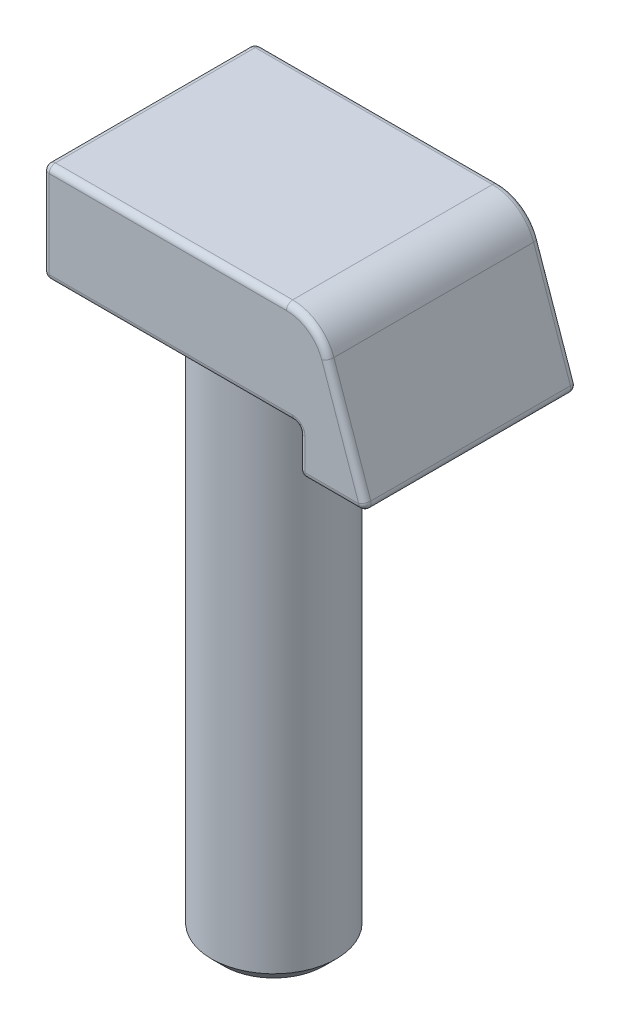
ISO-10303-21;
HEADER;
FILE_DESCRIPTION(('STEP AP214'),'2;1');
FILE_NAME('part.step','',(''),(''),'','','');
FILE_SCHEMA(('AUTOMOTIVE_DESIGN { 1 0 10303 214 1 1 1 1 }'));
ENDSEC;
DATA;
#1=APPLICATION_CONTEXT('core data for automotive mechanical design processes');
#2=APPLICATION_PROTOCOL_DEFINITION('international standard','automotive_design',2000,#1);
#3=PRODUCT_CONTEXT('',#1,'mechanical');
#4=PRODUCT('Part','Part','',(#3));
#5=PRODUCT_RELATED_PRODUCT_CATEGORY('part','',(#4));
#6=PRODUCT_DEFINITION_FORMATION('','',#4);
#7=PRODUCT_DEFINITION_CONTEXT('part definition',#1,'design');
#8=PRODUCT_DEFINITION('design','',#6,#7);
#9=PRODUCT_DEFINITION_SHAPE('','',#8);
#10=(LENGTH_UNIT() NAMED_UNIT(*) SI_UNIT(.MILLI.,.METRE.));
#11=(NAMED_UNIT(*) PLANE_ANGLE_UNIT() SI_UNIT($,.RADIAN.));
#12=(NAMED_UNIT(*) SI_UNIT($,.STERADIAN.) SOLID_ANGLE_UNIT());
#13=UNCERTAINTY_MEASURE_WITH_UNIT(LENGTH_MEASURE(1.E-05),#10,'distance_accuracy_value','');
#14=(GEOMETRIC_REPRESENTATION_CONTEXT(3) GLOBAL_UNCERTAINTY_ASSIGNED_CONTEXT((#13)) GLOBAL_UNIT_ASSIGNED_CONTEXT((#10,
#11,#12)) REPRESENTATION_CONTEXT('',''));
#15=CARTESIAN_POINT('',(0.,0.,0.));
#16=DIRECTION('',(0.,0.,1.));
#17=DIRECTION('',(1.,0.,0.));
#18=AXIS2_PLACEMENT_3D('',#15,#16,#17);
#19=CARTESIAN_POINT('',(0.5,0.,17.));
#20=DIRECTION('',(0.,1.,0.));
#21=DIRECTION('',(0.,0.,1.));
#22=AXIS2_PLACEMENT_3D('',#19,#20,#21);
#23=PLANE('',#22);
#24=DIRECTION('',(0.,0.,-1.));
#25=VECTOR('',#24,1.);
#26=CARTESIAN_POINT('',(0.5,0.,17.));
#27=LINE('',#26,#25);
#28=CARTESIAN_POINT('',(0.5,0.,16.5));
#29=VERTEX_POINT('',#28);
#30=CARTESIAN_POINT('',(0.5,0.,0.5));
#31=VERTEX_POINT('',#30);
#32=EDGE_CURVE('E735',#29,#31,#27,.T.);
#33=ORIENTED_EDGE('',*,*,#32,.T.);
#34=DIRECTION('',(1.,0.,0.));
#35=VECTOR('',#34,1.);
#36=CARTESIAN_POINT('',(0.5,0.,0.5));
#37=LINE('',#36,#35);
#38=CARTESIAN_POINT('',(20.,0.,0.500000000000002));
#39=VERTEX_POINT('',#38);
#40=EDGE_CURVE('E241',#31,#39,#37,.T.);
#41=ORIENTED_EDGE('',*,*,#40,.T.);
#42=DIRECTION('',(0.,0.,-1.));
#43=VECTOR('',#42,1.);
#44=CARTESIAN_POINT('',(20.,0.,17.));
#45=LINE('',#44,#43);
#46=CARTESIAN_POINT('',(20.,0.,16.5));
#47=VERTEX_POINT('',#46);
#48=EDGE_CURVE('E732',#47,#39,#45,.T.);
#49=ORIENTED_EDGE('',*,*,#48,.F.);
#50=DIRECTION('',(1.,0.,0.));
#51=VECTOR('',#50,1.);
#52=CARTESIAN_POINT('',(0.5,0.,16.5));
#53=LINE('',#52,#51);
#54=EDGE_CURVE('E239',#47,#29,#53,.F.);
#55=ORIENTED_EDGE('',*,*,#54,.T.);
#56=EDGE_LOOP('',(#33,#41,#49,#55));
#57=FACE_BOUND('',#56,.T.);
#58=CARTESIAN_POINT('',(10.,0.,8.50000000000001));
#59=DIRECTION('',(0.,1.,0.));
#60=DIRECTION('',(0.,0.,1.));
#61=AXIS2_PLACEMENT_3D('',#58,#59,#60);
#62=CIRCLE('',#61,5.);
#63=CARTESIAN_POINT('',(9.99999999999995,0.,13.5));
#64=VERTEX_POINT('',#63);
#65=EDGE_CURVE('E286',#64,#64,#62,.F.);
#66=ORIENTED_EDGE('',*,*,#65,.F.);
#67=EDGE_LOOP('',(#66));
#68=FACE_BOUND('',#67,.T.);
#69=ADVANCED_FACE('F34',(#57,#68),#23,.F.);
#70=CARTESIAN_POINT('',(19.5117143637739,4.50000000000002,17.));
#71=DIRECTION('',(0.,0.,-1.));
#72=DIRECTION('',(-1.,0.,0.));
#73=AXIS2_PLACEMENT_3D('',#70,#71,#72);
#74=CYLINDRICAL_SURFACE('',#73,3.5);
#75=DIRECTION('',(0.,0.,-1.));
#76=VECTOR('',#75,1.);
#77=CARTESIAN_POINT('',(22.8174531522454,5.64982218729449,17.));
#78=LINE('',#77,#76);
#79=CARTESIAN_POINT('',(22.8174531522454,5.64982218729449,16.5));
#80=VERTEX_POINT('',#79);
#81=CARTESIAN_POINT('',(22.8174531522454,5.64982218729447,0.500000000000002));
#82=VERTEX_POINT('',#81);
#83=EDGE_CURVE('E714',#80,#82,#78,.T.);
#84=ORIENTED_EDGE('',*,*,#83,.T.);
#85=CARTESIAN_POINT('',(19.5117143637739,4.5,0.500000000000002));
#86=DIRECTION('',(0.,0.,1.));
#87=DIRECTION('',(1.,0.,0.));
#88=AXIS2_PLACEMENT_3D('',#85,#86,#87);
#89=CIRCLE('',#88,3.5);
#90=CARTESIAN_POINT('',(19.5117143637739,8.00000000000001,0.5));
#91=VERTEX_POINT('',#90);
#92=EDGE_CURVE('E270',#82,#91,#89,.T.);
#93=ORIENTED_EDGE('',*,*,#92,.T.);
#94=DIRECTION('',(0.,0.,-1.));
#95=VECTOR('',#94,1.);
#96=CARTESIAN_POINT('',(19.5117143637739,8.00000000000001,17.));
#97=LINE('',#96,#95);
#98=CARTESIAN_POINT('',(19.5117143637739,8.00000000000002,16.5));
#99=VERTEX_POINT('',#98);
#100=EDGE_CURVE('E194',#99,#91,#97,.T.);
#101=ORIENTED_EDGE('',*,*,#100,.F.);
#102=CARTESIAN_POINT('',(19.5117143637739,4.50000000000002,16.5));
#103=DIRECTION('',(0.,0.,1.));
#104=DIRECTION('',(1.,0.,0.));
#105=AXIS2_PLACEMENT_3D('',#102,#103,#104);
#106=CIRCLE('',#105,3.5);
#107=EDGE_CURVE('E268',#99,#80,#106,.F.);
#108=ORIENTED_EDGE('',*,*,#107,.T.);
#109=EDGE_LOOP('',(#84,#93,#101,#108));
#110=FACE_BOUND('',#109,.T.);
#111=ADVANCED_FACE('F36',(#110),#74,.T.);
#112=CARTESIAN_POINT('',(0.5,8.00000000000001,17.));
#113=DIRECTION('',(0.,-1.,0.));
#114=DIRECTION('',(1.,0.,0.));
#115=AXIS2_PLACEMENT_3D('',#112,#113,#114);
#116=PLANE('',#115);
#117=ORIENTED_EDGE('',*,*,#100,.T.);
#118=DIRECTION('',(-1.,0.,0.));
#119=VECTOR('',#118,1.);
#120=CARTESIAN_POINT('',(0.5,8.00000000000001,0.5));
#121=LINE('',#120,#119);
#122=CARTESIAN_POINT('',(0.5,8.00000000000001,0.5));
#123=VERTEX_POINT('',#122);
#124=EDGE_CURVE('E193',#91,#123,#121,.T.);
#125=ORIENTED_EDGE('',*,*,#124,.T.);
#126=DIRECTION('',(0.,0.,-1.));
#127=VECTOR('',#126,1.);
#128=CARTESIAN_POINT('',(0.5,8.00000000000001,17.));
#129=LINE('',#128,#127);
#130=CARTESIAN_POINT('',(0.5,8.00000000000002,16.5));
#131=VERTEX_POINT('',#130);
#132=EDGE_CURVE('E175',#131,#123,#129,.T.);
#133=ORIENTED_EDGE('',*,*,#132,.F.);
#134=DIRECTION('',(-1.,0.,0.));
#135=VECTOR('',#134,1.);
#136=CARTESIAN_POINT('',(19.5117143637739,8.00000000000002,16.5));
#137=LINE('',#136,#135);
#138=EDGE_CURVE('E190',#131,#99,#137,.F.);
#139=ORIENTED_EDGE('',*,*,#138,.T.);
#140=EDGE_LOOP('',(#117,#125,#133,#139));
#141=FACE_BOUND('',#140,.T.);
#142=ADVANCED_FACE('F188',(#141),#116,.F.);
#143=CARTESIAN_POINT('',(0.5,7.50000000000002,17.));
#144=DIRECTION('',(0.,0.,-1.));
#145=DIRECTION('',(-1.,0.,0.));
#146=AXIS2_PLACEMENT_3D('',#143,#144,#145);
#147=CYLINDRICAL_SURFACE('',#146,0.5);
#148=ORIENTED_EDGE('',*,*,#132,.T.);
#149=CARTESIAN_POINT('',(0.5,7.50000000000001,0.5));
#150=DIRECTION('',(0.,0.,-1.));
#151=DIRECTION('',(-1.,0.,0.));
#152=AXIS2_PLACEMENT_3D('',#149,#150,#151);
#153=CIRCLE('',#152,0.5);
#154=CARTESIAN_POINT('',(0.,7.5,0.5));
#155=VERTEX_POINT('',#154);
#156=EDGE_CURVE('E182',#123,#155,#153,.F.);
#157=ORIENTED_EDGE('',*,*,#156,.T.);
#158=DIRECTION('',(0.,0.,-1.));
#159=VECTOR('',#158,1.);
#160=CARTESIAN_POINT('',(0.,7.50000000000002,17.));
#161=LINE('',#160,#159);
#162=CARTESIAN_POINT('',(0.,7.50000000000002,16.5));
#163=VERTEX_POINT('',#162);
#164=EDGE_CURVE('E177',#163,#155,#161,.T.);
#165=ORIENTED_EDGE('',*,*,#164,.F.);
#166=CARTESIAN_POINT('',(0.5,7.50000000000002,16.5));
#167=DIRECTION('',(0.,0.,-1.));
#168=DIRECTION('',(-1.,0.,0.));
#169=AXIS2_PLACEMENT_3D('',#166,#167,#168);
#170=CIRCLE('',#169,0.5);
#171=EDGE_CURVE('E172',#163,#131,#170,.T.);
#172=ORIENTED_EDGE('',*,*,#171,.T.);
#173=EDGE_LOOP('',(#148,#157,#165,#172));
#174=FACE_BOUND('',#173,.T.);
#175=ADVANCED_FACE('F174',(#174),#147,.T.);
#176=CARTESIAN_POINT('',(0.,0.500000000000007,17.));
#177=DIRECTION('',(1.,0.,0.));
#178=DIRECTION('',(0.,0.,-1.));
#179=AXIS2_PLACEMENT_3D('',#176,#177,#178);
#180=PLANE('',#179);
#181=ORIENTED_EDGE('',*,*,#164,.T.);
#182=DIRECTION('',(0.,-1.,0.));
#183=VECTOR('',#182,1.);
#184=CARTESIAN_POINT('',(0.,0.500000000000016,0.5));
#185=LINE('',#184,#183);
#186=CARTESIAN_POINT('',(0.,0.500000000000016,0.5));
#187=VERTEX_POINT('',#186);
#188=EDGE_CURVE('E233',#155,#187,#185,.T.);
#189=ORIENTED_EDGE('',*,*,#188,.T.);
#190=DIRECTION('',(0.,0.,-1.));
#191=VECTOR('',#190,1.);
#192=CARTESIAN_POINT('',(0.,0.500000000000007,17.));
#193=LINE('',#192,#191);
#194=CARTESIAN_POINT('',(0.,0.500000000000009,16.5));
#195=VERTEX_POINT('',#194);
#196=EDGE_CURVE('E737',#195,#187,#193,.T.);
#197=ORIENTED_EDGE('',*,*,#196,.F.);
#198=DIRECTION('',(0.,-1.,0.));
#199=VECTOR('',#198,1.);
#200=CARTESIAN_POINT('',(0.,7.50000000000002,16.5));
#201=LINE('',#200,#199);
#202=EDGE_CURVE('E231',#195,#163,#201,.F.);
#203=ORIENTED_EDGE('',*,*,#202,.T.);
#204=EDGE_LOOP('',(#181,#189,#197,#203));
#205=FACE_BOUND('',#204,.T.);
#206=ADVANCED_FACE('F319',(#205),#180,.F.);
#207=CARTESIAN_POINT('',(0.5,0.5,17.));
#208=DIRECTION('',(0.,0.,-1.));
#209=DIRECTION('',(-1.,0.,0.));
#210=AXIS2_PLACEMENT_3D('',#207,#208,#209);
#211=CYLINDRICAL_SURFACE('',#210,0.5);
#212=ORIENTED_EDGE('',*,*,#196,.T.);
#213=CARTESIAN_POINT('',(0.5,0.500000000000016,0.5));
#214=DIRECTION('',(0.,0.,-1.));
#215=DIRECTION('',(-1.,0.,0.));
#216=AXIS2_PLACEMENT_3D('',#213,#214,#215);
#217=CIRCLE('',#216,0.5);
#218=EDGE_CURVE('E237',#187,#31,#217,.F.);
#219=ORIENTED_EDGE('',*,*,#218,.T.);
#220=ORIENTED_EDGE('',*,*,#32,.F.);
#221=CARTESIAN_POINT('',(0.5,0.5,16.5));
#222=DIRECTION('',(0.,0.,-1.));
#223=DIRECTION('',(-1.,0.,0.));
#224=AXIS2_PLACEMENT_3D('',#221,#222,#223);
#225=CIRCLE('',#224,0.5);
#226=EDGE_CURVE('E235',#29,#195,#225,.T.);
#227=ORIENTED_EDGE('',*,*,#226,.T.);
#228=EDGE_LOOP('',(#212,#219,#220,#227));
#229=FACE_BOUND('',#228,.T.);
#230=ADVANCED_FACE('F316',(#229),#211,.T.);
#231=CARTESIAN_POINT('',(20.,-0.499999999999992,17.));
#232=DIRECTION('',(0.,0.,-1.));
#233=DIRECTION('',(-1.,0.,0.));
#234=AXIS2_PLACEMENT_3D('',#231,#232,#233);
#235=CYLINDRICAL_SURFACE('',#234,0.5);
#236=ORIENTED_EDGE('',*,*,#48,.T.);
#237=CARTESIAN_POINT('',(20.,-0.499999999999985,0.500000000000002));
#238=DIRECTION('',(0.,0.,1.));
#239=DIRECTION('',(1.,0.,0.));
#240=AXIS2_PLACEMENT_3D('',#237,#238,#239);
#241=CIRCLE('',#240,0.5);
#242=CARTESIAN_POINT('',(20.5,-0.499999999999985,0.500000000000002));
#243=VERTEX_POINT('',#242);
#244=EDGE_CURVE('E245',#39,#243,#241,.F.);
#245=ORIENTED_EDGE('',*,*,#244,.T.);
#246=DIRECTION('',(0.,0.,-1.));
#247=VECTOR('',#246,1.);
#248=CARTESIAN_POINT('',(20.5,-0.499999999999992,17.));
#249=LINE('',#248,#247);
#250=CARTESIAN_POINT('',(20.5,-0.499999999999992,16.5));
#251=VERTEX_POINT('',#250);
#252=EDGE_CURVE('E729',#251,#243,#249,.T.);
#253=ORIENTED_EDGE('',*,*,#252,.F.);
#254=CARTESIAN_POINT('',(20.,-0.499999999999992,16.5));
#255=DIRECTION('',(0.,0.,1.));
#256=DIRECTION('',(1.,0.,0.));
#257=AXIS2_PLACEMENT_3D('',#254,#255,#256);
#258=CIRCLE('',#257,0.5);
#259=EDGE_CURVE('E243',#251,#47,#258,.T.);
#260=ORIENTED_EDGE('',*,*,#259,.T.);
#261=EDGE_LOOP('',(#236,#245,#253,#260));
#262=FACE_BOUND('',#261,.T.);
#263=ADVANCED_FACE('F314',(#262),#235,.F.);
#264=CARTESIAN_POINT('',(20.5,-0.499999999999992,17.));
#265=DIRECTION('',(1.,0.,0.));
#266=DIRECTION('',(0.,0.,-1.));
#267=AXIS2_PLACEMENT_3D('',#264,#265,#266);
#268=PLANE('',#267);
#269=ORIENTED_EDGE('',*,*,#252,.T.);
#270=DIRECTION('',(0.,-1.,0.));
#271=VECTOR('',#270,1.);
#272=CARTESIAN_POINT('',(20.5,-0.499999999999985,0.500000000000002));
#273=LINE('',#272,#271);
#274=CARTESIAN_POINT('',(20.5,-2.99999999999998,0.5));
#275=VERTEX_POINT('',#274);
#276=EDGE_CURVE('E249',#243,#275,#273,.T.);
#277=ORIENTED_EDGE('',*,*,#276,.T.);
#278=DIRECTION('',(0.,0.,-1.));
#279=VECTOR('',#278,1.);
#280=CARTESIAN_POINT('',(20.5,-2.99999999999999,17.));
#281=LINE('',#280,#279);
#282=CARTESIAN_POINT('',(20.5,-2.99999999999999,16.5));
#283=VERTEX_POINT('',#282);
#284=EDGE_CURVE('E726',#283,#275,#281,.T.);
#285=ORIENTED_EDGE('',*,*,#284,.F.);
#286=DIRECTION('',(0.,-1.,0.));
#287=VECTOR('',#286,1.);
#288=CARTESIAN_POINT('',(20.5,-0.499999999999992,16.5));
#289=LINE('',#288,#287);
#290=EDGE_CURVE('E247',#283,#251,#289,.F.);
#291=ORIENTED_EDGE('',*,*,#290,.T.);
#292=EDGE_LOOP('',(#269,#277,#285,#291));
#293=FACE_BOUND('',#292,.T.);
#294=ADVANCED_FACE('F348',(#293),#268,.F.);
#295=CARTESIAN_POINT('',(21.,-2.99999999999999,17.));
#296=DIRECTION('',(0.,0.,-1.));
#297=DIRECTION('',(-1.,0.,0.));
#298=AXIS2_PLACEMENT_3D('',#295,#296,#297);
#299=CYLINDRICAL_SURFACE('',#298,0.5);
#300=ORIENTED_EDGE('',*,*,#284,.T.);
#301=CARTESIAN_POINT('',(21.,-2.99999999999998,0.5));
#302=DIRECTION('',(0.,0.,-1.));
#303=DIRECTION('',(-1.,0.,0.));
#304=AXIS2_PLACEMENT_3D('',#301,#302,#303);
#305=CIRCLE('',#304,0.5);
#306=CARTESIAN_POINT('',(21.,-3.49999999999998,0.500000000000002));
#307=VERTEX_POINT('',#306);
#308=EDGE_CURVE('E253',#275,#307,#305,.F.);
#309=ORIENTED_EDGE('',*,*,#308,.T.);
#310=DIRECTION('',(0.,0.,-1.));
#311=VECTOR('',#310,1.);
#312=CARTESIAN_POINT('',(21.,-3.49999999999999,17.));
#313=LINE('',#312,#311);
#314=CARTESIAN_POINT('',(21.,-3.49999999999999,16.5));
#315=VERTEX_POINT('',#314);
#316=EDGE_CURVE('E718',#315,#307,#313,.T.);
#317=ORIENTED_EDGE('',*,*,#316,.F.);
#318=CARTESIAN_POINT('',(21.,-2.99999999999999,16.5));
#319=DIRECTION('',(0.,0.,-1.));
#320=DIRECTION('',(-1.,0.,0.));
#321=AXIS2_PLACEMENT_3D('',#318,#319,#320);
#322=CIRCLE('',#321,0.5);
#323=EDGE_CURVE('E251',#315,#283,#322,.T.);
#324=ORIENTED_EDGE('',*,*,#323,.T.);
#325=EDGE_LOOP('',(#300,#309,#317,#324));
#326=FACE_BOUND('',#325,.T.);
#327=ADVANCED_FACE('F355',(#326),#299,.T.);
#328=CARTESIAN_POINT('',(21.,-3.49999999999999,17.));
#329=DIRECTION('',(0.,1.,0.));
#330=DIRECTION('',(0.,0.,1.));
#331=AXIS2_PLACEMENT_3D('',#328,#329,#330);
#332=PLANE('',#331);
#333=ORIENTED_EDGE('',*,*,#316,.T.);
#334=DIRECTION('',(1.,0.,0.));
#335=VECTOR('',#334,1.);
#336=CARTESIAN_POINT('',(21.,-3.49999999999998,0.500000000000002));
#337=LINE('',#336,#335);
#338=CARTESIAN_POINT('',(25.2967045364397,-3.49999999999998,0.500000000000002));
#339=VERTEX_POINT('',#338);
#340=EDGE_CURVE('E257',#307,#339,#337,.T.);
#341=ORIENTED_EDGE('',*,*,#340,.T.);
#342=DIRECTION('',(0.,0.,-1.));
#343=VECTOR('',#342,1.);
#344=CARTESIAN_POINT('',(25.2967045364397,-3.49999999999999,17.));
#345=LINE('',#344,#343);
#346=CARTESIAN_POINT('',(25.2967045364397,-3.49999999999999,16.5));
#347=VERTEX_POINT('',#346);
#348=EDGE_CURVE('E716',#347,#339,#345,.T.);
#349=ORIENTED_EDGE('',*,*,#348,.F.);
#350=DIRECTION('',(1.,0.,0.));
#351=VECTOR('',#350,1.);
#352=CARTESIAN_POINT('',(21.,-3.49999999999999,16.5));
#353=LINE('',#352,#351);
#354=EDGE_CURVE('E255',#347,#315,#353,.F.);
#355=ORIENTED_EDGE('',*,*,#354,.T.);
#356=EDGE_LOOP('',(#333,#341,#349,#355));
#357=FACE_BOUND('',#356,.T.);
#358=ADVANCED_FACE('F362',(#357),#332,.F.);
#359=CARTESIAN_POINT('',(25.2967045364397,-2.99999999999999,17.));
#360=DIRECTION('',(0.,0.,-1.));
#361=DIRECTION('',(-1.,0.,0.));
#362=AXIS2_PLACEMENT_3D('',#359,#360,#361);
#363=CYLINDRICAL_SURFACE('',#362,0.5);
#364=ORIENTED_EDGE('',*,*,#348,.T.);
#365=CARTESIAN_POINT('',(25.2967045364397,-2.99999999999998,0.5));
#366=DIRECTION('',(0.,0.,-1.));
#367=DIRECTION('',(-1.,0.,0.));
#368=AXIS2_PLACEMENT_3D('',#365,#366,#367);
#369=CIRCLE('',#368,0.5);
#370=CARTESIAN_POINT('',(25.7689529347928,-2.83573968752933,0.5));
#371=VERTEX_POINT('',#370);
#372=EDGE_CURVE('E261',#339,#371,#369,.F.);
#373=ORIENTED_EDGE('',*,*,#372,.T.);
#374=DIRECTION('',(0.,0.,-1.));
#375=VECTOR('',#374,1.);
#376=CARTESIAN_POINT('',(25.7689529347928,-2.83573968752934,17.));
#377=LINE('',#376,#375);
#378=CARTESIAN_POINT('',(25.7689529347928,-2.83573968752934,16.5));
#379=VERTEX_POINT('',#378);
#380=EDGE_CURVE('E711',#379,#371,#377,.T.);
#381=ORIENTED_EDGE('',*,*,#380,.F.);
#382=CARTESIAN_POINT('',(25.2967045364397,-2.99999999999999,16.5));
#383=DIRECTION('',(0.,0.,-1.));
#384=DIRECTION('',(-1.,0.,0.));
#385=AXIS2_PLACEMENT_3D('',#382,#383,#384);
#386=CIRCLE('',#385,0.5);
#387=EDGE_CURVE('E259',#379,#347,#386,.T.);
#388=ORIENTED_EDGE('',*,*,#387,.T.);
#389=EDGE_LOOP('',(#364,#373,#381,#388));
#390=FACE_BOUND('',#389,.T.);
#391=ADVANCED_FACE('F370',(#390),#363,.T.);
#392=CARTESIAN_POINT('',(25.7689529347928,-2.83573968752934,17.));
#393=DIRECTION('',(-0.944496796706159,-0.328520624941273,0.));
#394=DIRECTION('',(0.328520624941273,-0.944496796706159,0.));
#395=AXIS2_PLACEMENT_3D('',#392,#393,#394);
#396=PLANE('',#395);
#397=ORIENTED_EDGE('',*,*,#380,.T.);
#398=DIRECTION('',(-0.328520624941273,0.944496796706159,0.));
#399=VECTOR('',#398,1.);
#400=CARTESIAN_POINT('',(25.7689529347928,-2.83573968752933,0.5));
#401=LINE('',#400,#399);
#402=EDGE_CURVE('E266',#371,#82,#401,.T.);
#403=ORIENTED_EDGE('',*,*,#402,.T.);
#404=ORIENTED_EDGE('',*,*,#83,.F.);
#405=DIRECTION('',(-0.328520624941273,0.944496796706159,0.));
#406=VECTOR('',#405,1.);
#407=CARTESIAN_POINT('',(25.7689529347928,-2.83573968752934,16.5));
#408=LINE('',#407,#406);
#409=EDGE_CURVE('E263',#80,#379,#408,.F.);
#410=ORIENTED_EDGE('',*,*,#409,.T.);
#411=EDGE_LOOP('',(#397,#403,#404,#410));
#412=FACE_BOUND('',#411,.T.);
#413=ADVANCED_FACE('F378',(#412),#396,.F.);
#414=CARTESIAN_POINT('',(19.5117143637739,4.50000000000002,17.));
#415=DIRECTION('',(0.,0.,1.));
#416=DIRECTION('',(1.,0.,0.));
#417=AXIS2_PLACEMENT_3D('',#414,#415,#416);
#418=PLANE('',#417);
#419=DIRECTION('',(1.,0.,0.));
#420=VECTOR('',#419,1.);
#421=CARTESIAN_POINT('',(25.2967045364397,-2.99999999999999,17.));
#422=LINE('',#421,#420);
#423=CARTESIAN_POINT('',(21.,-2.99999999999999,17.));
#424=VERTEX_POINT('',#423);
#425=CARTESIAN_POINT('',(25.2967045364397,-2.99999999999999,17.));
#426=VERTEX_POINT('',#425);
#427=EDGE_CURVE('E49',#424,#426,#422,.T.);
#428=ORIENTED_EDGE('',*,*,#427,.T.);
#429=DIRECTION('',(-0.328520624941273,0.944496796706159,0.));
#430=VECTOR('',#429,1.);
#431=CARTESIAN_POINT('',(22.3452047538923,5.48556187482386,17.));
#432=LINE('',#431,#430);
#433=CARTESIAN_POINT('',(22.3452047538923,5.48556187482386,17.));
#434=VERTEX_POINT('',#433);
#435=EDGE_CURVE('E284',#426,#434,#432,.T.);
#436=ORIENTED_EDGE('',*,*,#435,.T.);
#437=CARTESIAN_POINT('',(19.5117143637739,4.50000000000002,17.));
#438=DIRECTION('',(0.,0.,1.));
#439=DIRECTION('',(1.,0.,0.));
#440=AXIS2_PLACEMENT_3D('',#437,#438,#439);
#441=CIRCLE('',#440,3.);
#442=CARTESIAN_POINT('',(19.5117143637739,7.50000000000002,17.));
#443=VERTEX_POINT('',#442);
#444=EDGE_CURVE('E272',#434,#443,#441,.T.);
#445=ORIENTED_EDGE('',*,*,#444,.T.);
#446=DIRECTION('',(-1.,0.,0.));
#447=VECTOR('',#446,1.);
#448=CARTESIAN_POINT('',(0.5,7.50000000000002,17.));
#449=LINE('',#448,#447);
#450=CARTESIAN_POINT('',(0.5,7.50000000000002,17.));
#451=VERTEX_POINT('',#450);
#452=EDGE_CURVE('E274',#443,#451,#449,.T.);
#453=ORIENTED_EDGE('',*,*,#452,.T.);
#454=DIRECTION('',(0.,-1.,0.));
#455=VECTOR('',#454,1.);
#456=CARTESIAN_POINT('',(0.5,0.500000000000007,17.));
#457=LINE('',#456,#455);
#458=CARTESIAN_POINT('',(0.5,0.5,17.));
#459=VERTEX_POINT('',#458);
#460=EDGE_CURVE('E276',#451,#459,#457,.T.);
#461=ORIENTED_EDGE('',*,*,#460,.T.);
#462=DIRECTION('',(1.,0.,0.));
#463=VECTOR('',#462,1.);
#464=CARTESIAN_POINT('',(20.,0.500000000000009,17.));
#465=LINE('',#464,#463);
#466=CARTESIAN_POINT('',(20.,0.500000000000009,17.));
#467=VERTEX_POINT('',#466);
#468=EDGE_CURVE('E278',#459,#467,#465,.T.);
#469=ORIENTED_EDGE('',*,*,#468,.T.);
#470=CARTESIAN_POINT('',(20.,-0.499999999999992,17.));
#471=DIRECTION('',(0.,0.,1.));
#472=DIRECTION('',(1.,0.,0.));
#473=AXIS2_PLACEMENT_3D('',#470,#471,#472);
#474=CIRCLE('',#473,1.);
#475=CARTESIAN_POINT('',(21.,-0.499999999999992,17.));
#476=VERTEX_POINT('',#475);
#477=EDGE_CURVE('E280',#467,#476,#474,.F.);
#478=ORIENTED_EDGE('',*,*,#477,.T.);
#479=DIRECTION('',(0.,-1.,0.));
#480=VECTOR('',#479,1.);
#481=CARTESIAN_POINT('',(21.,-2.99999999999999,17.));
#482=LINE('',#481,#480);
#483=EDGE_CURVE('E54',#476,#424,#482,.T.);
#484=ORIENTED_EDGE('',*,*,#483,.T.);
#485=EDGE_LOOP('',(#428,#436,#445,#453,#461,#469,#478,#484));
#486=FACE_BOUND('',#485,.T.);
#487=ADVANCED_FACE('F386',(#486),#418,.T.);
#488=CARTESIAN_POINT('',(19.5117143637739,4.5,0.));
#489=DIRECTION('',(0.,0.,1.));
#490=DIRECTION('',(1.,0.,0.));
#491=AXIS2_PLACEMENT_3D('',#488,#489,#490);
#492=PLANE('',#491);
#493=DIRECTION('',(0.,-1.,0.));
#494=VECTOR('',#493,1.);
#495=CARTESIAN_POINT('',(0.5,4.50000000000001,0.));
#496=LINE('',#495,#494);
#497=CARTESIAN_POINT('',(0.5,0.5,0.));
#498=VERTEX_POINT('',#497);
#499=CARTESIAN_POINT('',(0.5,7.50000000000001,0.));
#500=VERTEX_POINT('',#499);
#501=EDGE_CURVE('E226',#498,#500,#496,.F.);
#502=ORIENTED_EDGE('',*,*,#501,.T.);
#503=DIRECTION('',(-1.,0.,0.));
#504=VECTOR('',#503,1.);
#505=CARTESIAN_POINT('',(19.5117143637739,7.50000000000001,0.));
#506=LINE('',#505,#504);
#507=CARTESIAN_POINT('',(19.5117143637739,7.50000000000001,0.));
#508=VERTEX_POINT('',#507);
#509=EDGE_CURVE('E183',#500,#508,#506,.F.);
#510=ORIENTED_EDGE('',*,*,#509,.T.);
#511=CARTESIAN_POINT('',(19.5117143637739,4.5,0.));
#512=DIRECTION('',(0.,0.,1.));
#513=DIRECTION('',(1.,0.,0.));
#514=AXIS2_PLACEMENT_3D('',#511,#512,#513);
#515=CIRCLE('',#514,3.);
#516=CARTESIAN_POINT('',(22.3452047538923,5.48556187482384,0.));
#517=VERTEX_POINT('',#516);
#518=EDGE_CURVE('E211',#508,#517,#515,.F.);
#519=ORIENTED_EDGE('',*,*,#518,.T.);
#520=DIRECTION('',(-0.328520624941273,0.944496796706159,0.));
#521=VECTOR('',#520,1.);
#522=CARTESIAN_POINT('',(22.3452047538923,5.48556187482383,0.));
#523=LINE('',#522,#521);
#524=CARTESIAN_POINT('',(25.2967045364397,-3.,0.));
#525=VERTEX_POINT('',#524);
#526=EDGE_CURVE('E216',#517,#525,#523,.F.);
#527=ORIENTED_EDGE('',*,*,#526,.T.);
#528=DIRECTION('',(1.,0.,0.));
#529=VECTOR('',#528,1.);
#530=CARTESIAN_POINT('',(19.5117143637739,-2.99999999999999,0.));
#531=LINE('',#530,#529);
#532=CARTESIAN_POINT('',(21.,-3.,0.));
#533=VERTEX_POINT('',#532);
#534=EDGE_CURVE('E218',#525,#533,#531,.F.);
#535=ORIENTED_EDGE('',*,*,#534,.T.);
#536=DIRECTION('',(0.,-1.,0.));
#537=VECTOR('',#536,1.);
#538=CARTESIAN_POINT('',(21.,4.50000000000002,0.));
#539=LINE('',#538,#537);
#540=CARTESIAN_POINT('',(21.,-0.500000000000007,0.));
#541=VERTEX_POINT('',#540);
#542=EDGE_CURVE('E220',#533,#541,#539,.F.);
#543=ORIENTED_EDGE('',*,*,#542,.T.);
#544=CARTESIAN_POINT('',(20.,-0.5,0.));
#545=DIRECTION('',(0.,0.,1.));
#546=DIRECTION('',(1.,0.,0.));
#547=AXIS2_PLACEMENT_3D('',#544,#545,#546);
#548=CIRCLE('',#547,1.);
#549=CARTESIAN_POINT('',(20.,0.5,0.));
#550=VERTEX_POINT('',#549);
#551=EDGE_CURVE('E222',#541,#550,#548,.T.);
#552=ORIENTED_EDGE('',*,*,#551,.T.);
#553=DIRECTION('',(1.,0.,0.));
#554=VECTOR('',#553,1.);
#555=CARTESIAN_POINT('',(19.5117143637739,0.5,0.));
#556=LINE('',#555,#554);
#557=EDGE_CURVE('E224',#550,#498,#556,.F.);
#558=ORIENTED_EDGE('',*,*,#557,.T.);
#559=EDGE_LOOP('',(#502,#510,#519,#527,#535,#543,#552,#558));
#560=FACE_BOUND('',#559,.T.);
#561=ADVANCED_FACE('F394',(#560),#492,.F.);
#562=CARTESIAN_POINT('',(21.,-0.499999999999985,0.500000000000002));
#563=DIRECTION('',(0.,-1.,0.));
#564=DIRECTION('',(0.,0.,-1.));
#565=AXIS2_PLACEMENT_3D('',#562,#563,#564);
#566=CYLINDRICAL_SURFACE('',#565,0.5);
#567=CARTESIAN_POINT('',(21.,-2.99999999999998,0.5));
#568=DIRECTION('',(0.,-1.,0.));
#569=DIRECTION('',(0.,0.,-1.));
#570=AXIS2_PLACEMENT_3D('',#567,#568,#569);
#571=CIRCLE('',#570,0.5);
#572=EDGE_CURVE('E720',#275,#533,#571,.T.);
#573=ORIENTED_EDGE('',*,*,#572,.F.);
#574=ORIENTED_EDGE('',*,*,#276,.F.);
#575=CARTESIAN_POINT('',(21.,-0.499999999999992,0.500000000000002));
#576=DIRECTION('',(0.,1.,0.));
#577=DIRECTION('',(-1.,0.,0.));
#578=AXIS2_PLACEMENT_3D('',#575,#576,#577);
#579=CIRCLE('',#578,0.5);
#580=EDGE_CURVE('E778',#541,#243,#579,.T.);
#581=ORIENTED_EDGE('',*,*,#580,.F.);
#582=ORIENTED_EDGE('',*,*,#542,.F.);
#583=EDGE_LOOP('',(#573,#574,#581,#582));
#584=FACE_BOUND('',#583,.T.);
#585=ADVANCED_FACE('F401',(#584),#566,.T.);
#586=CARTESIAN_POINT('',(21.,-2.99999999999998,0.5));
#587=DIRECTION('',(0.,0.,1.));
#588=DIRECTION('',(1.,0.,0.));
#589=AXIS2_PLACEMENT_3D('',#586,#587,#588);
#590=SPHERICAL_SURFACE('',#589,0.5);
#591=ORIENTED_EDGE('',*,*,#308,.F.);
#592=ORIENTED_EDGE('',*,*,#572,.T.);
#593=CARTESIAN_POINT('',(21.,-2.99999999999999,0.5));
#594=DIRECTION('',(1.,0.,0.));
#595=DIRECTION('',(0.,1.,0.));
#596=AXIS2_PLACEMENT_3D('',#593,#594,#595);
#597=CIRCLE('',#596,0.5);
#598=EDGE_CURVE('E775',#307,#533,#597,.T.);
#599=ORIENTED_EDGE('',*,*,#598,.F.);
#600=EDGE_LOOP('',(#591,#592,#599));
#601=FACE_BOUND('',#600,.T.);
#602=ADVANCED_FACE('F409',(#601),#590,.T.);
#603=CARTESIAN_POINT('',(20.,-0.499999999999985,0.500000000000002));
#604=DIRECTION('',(0.,0.,1.));
#605=DIRECTION('',(1.,0.,0.));
#606=AXIS2_PLACEMENT_3D('',#603,#604,#605);
#607=TOROIDAL_SURFACE('',#606,1.,0.5);
#608=ORIENTED_EDGE('',*,*,#580,.T.);
#609=ORIENTED_EDGE('',*,*,#244,.F.);
#610=CARTESIAN_POINT('',(20.,0.500000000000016,0.500000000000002));
#611=DIRECTION('',(-1.,0.,0.));
#612=DIRECTION('',(0.,0.,1.));
#613=AXIS2_PLACEMENT_3D('',#610,#611,#612);
#614=CIRCLE('',#613,0.5);
#615=EDGE_CURVE('E772',#550,#39,#614,.T.);
#616=ORIENTED_EDGE('',*,*,#615,.F.);
#617=ORIENTED_EDGE('',*,*,#551,.F.);
#618=EDGE_LOOP('',(#608,#609,#616,#617));
#619=FACE_BOUND('',#618,.T.);
#620=ADVANCED_FACE('F417',(#619),#607,.T.);
#621=CARTESIAN_POINT('',(21.,-2.99999999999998,0.5));
#622=DIRECTION('',(1.,0.,0.));
#623=DIRECTION('',(0.,0.,-1.));
#624=AXIS2_PLACEMENT_3D('',#621,#622,#623);
#625=CYLINDRICAL_SURFACE('',#624,0.5);
#626=ORIENTED_EDGE('',*,*,#598,.T.);
#627=ORIENTED_EDGE('',*,*,#534,.F.);
#628=CARTESIAN_POINT('',(25.2967045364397,-2.99999999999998,0.5));
#629=DIRECTION('',(1.,0.,0.));
#630=DIRECTION('',(0.,0.,-1.));
#631=AXIS2_PLACEMENT_3D('',#628,#629,#630);
#632=CIRCLE('',#631,0.5);
#633=EDGE_CURVE('E769',#339,#525,#632,.T.);
#634=ORIENTED_EDGE('',*,*,#633,.F.);
#635=ORIENTED_EDGE('',*,*,#340,.F.);
#636=EDGE_LOOP('',(#626,#627,#634,#635));
#637=FACE_BOUND('',#636,.T.);
#638=ADVANCED_FACE('F425',(#637),#625,.T.);
#639=CARTESIAN_POINT('',(0.5,0.500000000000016,0.5));
#640=DIRECTION('',(1.,0.,0.));
#641=DIRECTION('',(0.,0.,-1.));
#642=AXIS2_PLACEMENT_3D('',#639,#640,#641);
#643=CYLINDRICAL_SURFACE('',#642,0.5);
#644=ORIENTED_EDGE('',*,*,#615,.T.);
#645=ORIENTED_EDGE('',*,*,#40,.F.);
#646=CARTESIAN_POINT('',(0.5,0.500000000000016,0.5));
#647=DIRECTION('',(-1.,0.,0.));
#648=DIRECTION('',(0.,-1.,0.));
#649=AXIS2_PLACEMENT_3D('',#646,#647,#648);
#650=CIRCLE('',#649,0.5);
#651=EDGE_CURVE('E766',#498,#31,#650,.T.);
#652=ORIENTED_EDGE('',*,*,#651,.F.);
#653=ORIENTED_EDGE('',*,*,#557,.F.);
#654=EDGE_LOOP('',(#644,#645,#652,#653));
#655=FACE_BOUND('',#654,.T.);
#656=ADVANCED_FACE('F433',(#655),#643,.T.);
#657=CARTESIAN_POINT('',(25.2967045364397,-2.99999999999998,0.5));
#658=DIRECTION('',(0.,0.,1.));
#659=DIRECTION('',(1.,0.,0.));
#660=AXIS2_PLACEMENT_3D('',#657,#658,#659);
#661=SPHERICAL_SURFACE('',#660,0.5);
#662=ORIENTED_EDGE('',*,*,#372,.F.);
#663=ORIENTED_EDGE('',*,*,#633,.T.);
#664=CARTESIAN_POINT('',(25.2967045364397,-2.99999999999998,0.5));
#665=DIRECTION('',(-0.328520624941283,0.944496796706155,0.));
#666=DIRECTION('',(-0.944496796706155,-0.328520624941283,0.));
#667=AXIS2_PLACEMENT_3D('',#664,#665,#666);
#668=CIRCLE('',#667,0.5);
#669=EDGE_CURVE('E763',#371,#525,#668,.T.);
#670=ORIENTED_EDGE('',*,*,#669,.F.);
#671=EDGE_LOOP('',(#662,#663,#670));
#672=FACE_BOUND('',#671,.T.);
#673=ADVANCED_FACE('F441',(#672),#661,.T.);
#674=CARTESIAN_POINT('',(0.5,0.500000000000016,0.5));
#675=DIRECTION('',(0.,0.,1.));
#676=DIRECTION('',(1.,0.,0.));
#677=AXIS2_PLACEMENT_3D('',#674,#675,#676);
#678=SPHERICAL_SURFACE('',#677,0.5);
#679=ORIENTED_EDGE('',*,*,#651,.T.);
#680=ORIENTED_EDGE('',*,*,#218,.F.);
#681=CARTESIAN_POINT('',(0.5,0.500000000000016,0.5));
#682=DIRECTION('',(0.,1.,0.));
#683=DIRECTION('',(-1.,0.,0.));
#684=AXIS2_PLACEMENT_3D('',#681,#682,#683);
#685=CIRCLE('',#684,0.5);
#686=EDGE_CURVE('E750',#498,#187,#685,.T.);
#687=ORIENTED_EDGE('',*,*,#686,.F.);
#688=EDGE_LOOP('',(#679,#680,#687));
#689=FACE_BOUND('',#688,.T.);
#690=ADVANCED_FACE('F449',(#689),#678,.T.);
#691=CARTESIAN_POINT('',(25.2967045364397,-2.99999999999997,0.5));
#692=DIRECTION('',(-0.328520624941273,0.944496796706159,0.));
#693=DIRECTION('',(-0.944496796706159,-0.328520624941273,0.));
#694=AXIS2_PLACEMENT_3D('',#691,#692,#693);
#695=CYLINDRICAL_SURFACE('',#694,0.5);
#696=ORIENTED_EDGE('',*,*,#669,.T.);
#697=ORIENTED_EDGE('',*,*,#526,.F.);
#698=CARTESIAN_POINT('',(22.3452047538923,5.48556187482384,0.500000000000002));
#699=DIRECTION('',(-0.328520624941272,0.944496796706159,0.));
#700=DIRECTION('',(-0.944496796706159,-0.328520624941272,0.));
#701=AXIS2_PLACEMENT_3D('',#698,#699,#700);
#702=CIRCLE('',#701,0.5);
#703=EDGE_CURVE('E754',#82,#517,#702,.T.);
#704=ORIENTED_EDGE('',*,*,#703,.F.);
#705=ORIENTED_EDGE('',*,*,#402,.F.);
#706=EDGE_LOOP('',(#696,#697,#704,#705));
#707=FACE_BOUND('',#706,.T.);
#708=ADVANCED_FACE('F457',(#707),#695,.T.);
#709=CARTESIAN_POINT('',(0.5,0.500000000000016,0.5));
#710=DIRECTION('',(0.,-1.,0.));
#711=DIRECTION('',(0.,0.,-1.));
#712=AXIS2_PLACEMENT_3D('',#709,#710,#711);
#713=CYLINDRICAL_SURFACE('',#712,0.5);
#714=ORIENTED_EDGE('',*,*,#686,.T.);
#715=ORIENTED_EDGE('',*,*,#188,.F.);
#716=CARTESIAN_POINT('',(0.5,7.50000000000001,0.5));
#717=DIRECTION('',(0.,1.,0.));
#718=DIRECTION('',(-1.,0.,0.));
#719=AXIS2_PLACEMENT_3D('',#716,#717,#718);
#720=CIRCLE('',#719,0.5);
#721=EDGE_CURVE('E747',#500,#155,#720,.T.);
#722=ORIENTED_EDGE('',*,*,#721,.F.);
#723=ORIENTED_EDGE('',*,*,#501,.F.);
#724=EDGE_LOOP('',(#714,#715,#722,#723));
#725=FACE_BOUND('',#724,.T.);
#726=ADVANCED_FACE('F465',(#725),#713,.T.);
#727=CARTESIAN_POINT('',(19.5117143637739,4.5,0.500000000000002));
#728=DIRECTION('',(0.,0.,1.));
#729=DIRECTION('',(1.,0.,0.));
#730=AXIS2_PLACEMENT_3D('',#727,#728,#729);
#731=TOROIDAL_SURFACE('',#730,3.,0.5);
#732=ORIENTED_EDGE('',*,*,#703,.T.);
#733=ORIENTED_EDGE('',*,*,#518,.F.);
#734=CARTESIAN_POINT('',(19.5117143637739,7.50000000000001,0.5));
#735=DIRECTION('',(-1.,0.,0.));
#736=DIRECTION('',(0.,0.,1.));
#737=AXIS2_PLACEMENT_3D('',#734,#735,#736);
#738=CIRCLE('',#737,0.5);
#739=EDGE_CURVE('E755',#91,#508,#738,.T.);
#740=ORIENTED_EDGE('',*,*,#739,.F.);
#741=ORIENTED_EDGE('',*,*,#92,.F.);
#742=EDGE_LOOP('',(#732,#733,#740,#741));
#743=FACE_BOUND('',#742,.T.);
#744=ADVANCED_FACE('F473',(#743),#731,.T.);
#745=CARTESIAN_POINT('',(0.5,7.50000000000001,0.5));
#746=DIRECTION('',(0.,0.,1.));
#747=DIRECTION('',(1.,0.,0.));
#748=AXIS2_PLACEMENT_3D('',#745,#746,#747);
#749=SPHERICAL_SURFACE('',#748,0.5);
#750=ORIENTED_EDGE('',*,*,#721,.T.);
#751=ORIENTED_EDGE('',*,*,#156,.F.);
#752=CARTESIAN_POINT('',(0.5,7.50000000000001,0.5));
#753=DIRECTION('',(1.,0.,0.));
#754=DIRECTION('',(0.,1.,0.));
#755=AXIS2_PLACEMENT_3D('',#752,#753,#754);
#756=CIRCLE('',#755,0.5);
#757=EDGE_CURVE('E753',#500,#123,#756,.T.);
#758=ORIENTED_EDGE('',*,*,#757,.F.);
#759=EDGE_LOOP('',(#750,#751,#758));
#760=FACE_BOUND('',#759,.T.);
#761=ADVANCED_FACE('F481',(#760),#749,.T.);
#762=CARTESIAN_POINT('',(0.5,7.50000000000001,0.5));
#763=DIRECTION('',(-1.,0.,0.));
#764=DIRECTION('',(0.,-1.,0.));
#765=AXIS2_PLACEMENT_3D('',#762,#763,#764);
#766=CYLINDRICAL_SURFACE('',#765,0.5);
#767=ORIENTED_EDGE('',*,*,#739,.T.);
#768=ORIENTED_EDGE('',*,*,#509,.F.);
#769=ORIENTED_EDGE('',*,*,#757,.T.);
#770=ORIENTED_EDGE('',*,*,#124,.F.);
#771=EDGE_LOOP('',(#767,#768,#769,#770));
#772=FACE_BOUND('',#771,.T.);
#773=ADVANCED_FACE('F489',(#772),#766,.T.);
#774=CARTESIAN_POINT('',(19.5117143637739,0.500000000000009,16.5));
#775=DIRECTION('',(-1.,0.,0.));
#776=DIRECTION('',(0.,0.,1.));
#777=AXIS2_PLACEMENT_3D('',#774,#775,#776);
#778=CYLINDRICAL_SURFACE('',#777,0.5);
#779=CARTESIAN_POINT('',(0.5,0.5,16.5));
#780=DIRECTION('',(-1.,0.,0.));
#781=DIRECTION('',(0.,0.,1.));
#782=AXIS2_PLACEMENT_3D('',#779,#780,#781);
#783=CIRCLE('',#782,0.5);
#784=EDGE_CURVE('E808',#29,#459,#783,.T.);
#785=ORIENTED_EDGE('',*,*,#784,.F.);
#786=ORIENTED_EDGE('',*,*,#54,.F.);
#787=CARTESIAN_POINT('',(20.,0.500000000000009,16.5));
#788=DIRECTION('',(1.,0.,0.));
#789=DIRECTION('',(0.,1.,0.));
#790=AXIS2_PLACEMENT_3D('',#787,#788,#789);
#791=CIRCLE('',#790,0.5);
#792=EDGE_CURVE('E811',#467,#47,#791,.T.);
#793=ORIENTED_EDGE('',*,*,#792,.F.);
#794=ORIENTED_EDGE('',*,*,#468,.F.);
#795=EDGE_LOOP('',(#785,#786,#793,#794));
#796=FACE_BOUND('',#795,.T.);
#797=ADVANCED_FACE('F497',(#796),#778,.T.);
#798=CARTESIAN_POINT('',(20.,-0.499999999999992,16.5));
#799=DIRECTION('',(0.,0.,1.));
#800=DIRECTION('',(1.,0.,0.));
#801=AXIS2_PLACEMENT_3D('',#798,#799,#800);
#802=TOROIDAL_SURFACE('',#801,1.,0.5);
#803=ORIENTED_EDGE('',*,*,#792,.T.);
#804=ORIENTED_EDGE('',*,*,#259,.F.);
#805=CARTESIAN_POINT('',(21.,-0.499999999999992,16.5));
#806=DIRECTION('',(0.,-1.,0.));
#807=DIRECTION('',(0.,0.,-1.));
#808=AXIS2_PLACEMENT_3D('',#805,#806,#807);
#809=CIRCLE('',#808,0.5);
#810=EDGE_CURVE('E805',#476,#251,#809,.T.);
#811=ORIENTED_EDGE('',*,*,#810,.F.);
#812=ORIENTED_EDGE('',*,*,#477,.F.);
#813=EDGE_LOOP('',(#803,#804,#811,#812));
#814=FACE_BOUND('',#813,.T.);
#815=ADVANCED_FACE('F505',(#814),#802,.T.);
#816=CARTESIAN_POINT('',(0.5,0.5,16.5));
#817=DIRECTION('',(0.,0.,1.));
#818=DIRECTION('',(1.,0.,0.));
#819=AXIS2_PLACEMENT_3D('',#816,#817,#818);
#820=SPHERICAL_SURFACE('',#819,0.5);
#821=ORIENTED_EDGE('',*,*,#226,.F.);
#822=ORIENTED_EDGE('',*,*,#784,.T.);
#823=CARTESIAN_POINT('',(0.5,0.5,16.5));
#824=DIRECTION('',(0.,1.,0.));
#825=DIRECTION('',(-1.,0.,0.));
#826=AXIS2_PLACEMENT_3D('',#823,#824,#825);
#827=CIRCLE('',#826,0.5);
#828=EDGE_CURVE('E802',#195,#459,#827,.T.);
#829=ORIENTED_EDGE('',*,*,#828,.F.);
#830=EDGE_LOOP('',(#821,#822,#829));
#831=FACE_BOUND('',#830,.T.);
#832=ADVANCED_FACE('F513',(#831),#820,.T.);
#833=CARTESIAN_POINT('',(21.,4.50000000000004,16.5));
#834=DIRECTION('',(0.,1.,0.));
#835=DIRECTION('',(0.,0.,1.));
#836=AXIS2_PLACEMENT_3D('',#833,#834,#835);
#837=CYLINDRICAL_SURFACE('',#836,0.5);
#838=ORIENTED_EDGE('',*,*,#810,.T.);
#839=ORIENTED_EDGE('',*,*,#290,.F.);
#840=CARTESIAN_POINT('',(21.,-2.99999999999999,16.5));
#841=DIRECTION('',(0.,-1.,0.));
#842=DIRECTION('',(1.,0.,0.));
#843=AXIS2_PLACEMENT_3D('',#840,#841,#842);
#844=CIRCLE('',#843,0.5);
#845=EDGE_CURVE('E796',#424,#283,#844,.T.);
#846=ORIENTED_EDGE('',*,*,#845,.F.);
#847=ORIENTED_EDGE('',*,*,#483,.F.);
#848=EDGE_LOOP('',(#838,#839,#846,#847));
#849=FACE_BOUND('',#848,.T.);
#850=ADVANCED_FACE('F521',(#849),#837,.T.);
#851=CARTESIAN_POINT('',(0.5,4.50000000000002,16.5));
#852=DIRECTION('',(0.,1.,0.));
#853=DIRECTION('',(0.,0.,1.));
#854=AXIS2_PLACEMENT_3D('',#851,#852,#853);
#855=CYLINDRICAL_SURFACE('',#854,0.5);
#856=ORIENTED_EDGE('',*,*,#828,.T.);
#857=ORIENTED_EDGE('',*,*,#460,.F.);
#858=CARTESIAN_POINT('',(0.5,7.50000000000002,16.5));
#859=DIRECTION('',(0.,1.,0.));
#860=DIRECTION('',(0.,0.,1.));
#861=AXIS2_PLACEMENT_3D('',#858,#859,#860);
#862=CIRCLE('',#861,0.5);
#863=EDGE_CURVE('E199',#163,#451,#862,.T.);
#864=ORIENTED_EDGE('',*,*,#863,.F.);
#865=ORIENTED_EDGE('',*,*,#202,.F.);
#866=EDGE_LOOP('',(#856,#857,#864,#865));
#867=FACE_BOUND('',#866,.T.);
#868=ADVANCED_FACE('F529',(#867),#855,.T.);
#869=CARTESIAN_POINT('',(21.,-2.99999999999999,16.5));
#870=DIRECTION('',(0.,0.,1.));
#871=DIRECTION('',(1.,0.,0.));
#872=AXIS2_PLACEMENT_3D('',#869,#870,#871);
#873=SPHERICAL_SURFACE('',#872,0.5);
#874=ORIENTED_EDGE('',*,*,#845,.T.);
#875=ORIENTED_EDGE('',*,*,#323,.F.);
#876=CARTESIAN_POINT('',(21.,-2.99999999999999,16.5));
#877=DIRECTION('',(1.,0.,0.));
#878=DIRECTION('',(0.,1.,0.));
#879=AXIS2_PLACEMENT_3D('',#876,#877,#878);
#880=CIRCLE('',#879,0.5);
#881=EDGE_CURVE('E202',#424,#315,#880,.T.);
#882=ORIENTED_EDGE('',*,*,#881,.F.);
#883=EDGE_LOOP('',(#874,#875,#882));
#884=FACE_BOUND('',#883,.T.);
#885=ADVANCED_FACE('F537',(#884),#873,.T.);
#886=CARTESIAN_POINT('',(0.5,7.50000000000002,16.5));
#887=DIRECTION('',(0.,0.,1.));
#888=DIRECTION('',(1.,0.,0.));
#889=AXIS2_PLACEMENT_3D('',#886,#887,#888);
#890=SPHERICAL_SURFACE('',#889,0.5);
#891=ORIENTED_EDGE('',*,*,#171,.F.);
#892=ORIENTED_EDGE('',*,*,#863,.T.);
#893=CARTESIAN_POINT('',(0.5,7.50000000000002,16.5));
#894=DIRECTION('',(1.,0.,0.));
#895=DIRECTION('',(0.,1.,0.));
#896=AXIS2_PLACEMENT_3D('',#893,#894,#895);
#897=CIRCLE('',#896,0.5);
#898=EDGE_CURVE('E197',#131,#451,#897,.T.);
#899=ORIENTED_EDGE('',*,*,#898,.F.);
#900=EDGE_LOOP('',(#891,#892,#899));
#901=FACE_BOUND('',#900,.T.);
#902=ADVANCED_FACE('F198',(#901),#890,.T.);
#903=CARTESIAN_POINT('',(19.5117143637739,-2.99999999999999,16.5));
#904=DIRECTION('',(-1.,0.,0.));
#905=DIRECTION('',(0.,0.,1.));
#906=AXIS2_PLACEMENT_3D('',#903,#904,#905);
#907=CYLINDRICAL_SURFACE('',#906,0.5);
#908=ORIENTED_EDGE('',*,*,#881,.T.);
#909=ORIENTED_EDGE('',*,*,#354,.F.);
#910=CARTESIAN_POINT('',(25.2967045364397,-2.99999999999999,16.5));
#911=DIRECTION('',(1.,0.,0.));
#912=DIRECTION('',(0.,1.,0.));
#913=AXIS2_PLACEMENT_3D('',#910,#911,#912);
#914=CIRCLE('',#913,0.5);
#915=EDGE_CURVE('E203',#426,#347,#914,.T.);
#916=ORIENTED_EDGE('',*,*,#915,.F.);
#917=ORIENTED_EDGE('',*,*,#427,.F.);
#918=EDGE_LOOP('',(#908,#909,#916,#917));
#919=FACE_BOUND('',#918,.T.);
#920=ADVANCED_FACE('F552',(#919),#907,.T.);
#921=CARTESIAN_POINT('',(19.5117143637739,7.50000000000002,16.5));
#922=DIRECTION('',(1.,0.,0.));
#923=DIRECTION('',(0.,1.,0.));
#924=AXIS2_PLACEMENT_3D('',#921,#922,#923);
#925=CYLINDRICAL_SURFACE('',#924,0.5);
#926=ORIENTED_EDGE('',*,*,#898,.T.);
#927=ORIENTED_EDGE('',*,*,#452,.F.);
#928=CARTESIAN_POINT('',(19.5117143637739,7.50000000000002,16.5));
#929=DIRECTION('',(1.,0.,0.));
#930=DIRECTION('',(0.,0.,-1.));
#931=AXIS2_PLACEMENT_3D('',#928,#929,#930);
#932=CIRCLE('',#931,0.5);
#933=EDGE_CURVE('E208',#99,#443,#932,.T.);
#934=ORIENTED_EDGE('',*,*,#933,.F.);
#935=ORIENTED_EDGE('',*,*,#138,.F.);
#936=EDGE_LOOP('',(#926,#927,#934,#935));
#937=FACE_BOUND('',#936,.T.);
#938=ADVANCED_FACE('F206',(#937),#925,.T.);
#939=CARTESIAN_POINT('',(25.2967045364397,-2.99999999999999,16.5));
#940=DIRECTION('',(0.,0.,1.));
#941=DIRECTION('',(1.,0.,0.));
#942=AXIS2_PLACEMENT_3D('',#939,#940,#941);
#943=SPHERICAL_SURFACE('',#942,0.5);
#944=ORIENTED_EDGE('',*,*,#915,.T.);
#945=ORIENTED_EDGE('',*,*,#387,.F.);
#946=CARTESIAN_POINT('',(25.2967045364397,-2.99999999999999,16.5));
#947=DIRECTION('',(-0.328520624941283,0.944496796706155,0.));
#948=DIRECTION('',(-0.944496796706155,-0.328520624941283,0.));
#949=AXIS2_PLACEMENT_3D('',#946,#947,#948);
#950=CIRCLE('',#949,0.5);
#951=EDGE_CURVE('E700',#426,#379,#950,.T.);
#952=ORIENTED_EDGE('',*,*,#951,.F.);
#953=EDGE_LOOP('',(#944,#945,#952));
#954=FACE_BOUND('',#953,.T.);
#955=ADVANCED_FACE('F566',(#954),#943,.T.);
#956=CARTESIAN_POINT('',(19.5117143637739,4.50000000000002,16.5));
#957=DIRECTION('',(0.,0.,1.));
#958=DIRECTION('',(1.,0.,0.));
#959=AXIS2_PLACEMENT_3D('',#956,#957,#958);
#960=TOROIDAL_SURFACE('',#959,3.,0.5);
#961=ORIENTED_EDGE('',*,*,#933,.T.);
#962=ORIENTED_EDGE('',*,*,#444,.F.);
#963=CARTESIAN_POINT('',(22.3452047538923,5.48556187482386,16.5));
#964=DIRECTION('',(0.328520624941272,-0.944496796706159,0.));
#965=DIRECTION('',(0.944496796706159,0.328520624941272,0.));
#966=AXIS2_PLACEMENT_3D('',#963,#964,#965);
#967=CIRCLE('',#966,0.5);
#968=EDGE_CURVE('E704',#80,#434,#967,.T.);
#969=ORIENTED_EDGE('',*,*,#968,.F.);
#970=ORIENTED_EDGE('',*,*,#107,.F.);
#971=EDGE_LOOP('',(#961,#962,#969,#970));
#972=FACE_BOUND('',#971,.T.);
#973=ADVANCED_FACE('F573',(#972),#960,.T.);
#974=CARTESIAN_POINT('',(22.3452047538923,5.48556187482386,16.5));
#975=DIRECTION('',(0.328520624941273,-0.944496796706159,0.));
#976=DIRECTION('',(0.944496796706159,0.328520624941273,0.));
#977=AXIS2_PLACEMENT_3D('',#974,#975,#976);
#978=CYLINDRICAL_SURFACE('',#977,0.5);
#979=ORIENTED_EDGE('',*,*,#951,.T.);
#980=ORIENTED_EDGE('',*,*,#409,.F.);
#981=ORIENTED_EDGE('',*,*,#968,.T.);
#982=ORIENTED_EDGE('',*,*,#435,.F.);
#983=EDGE_LOOP('',(#979,#980,#981,#982));
#984=FACE_BOUND('',#983,.T.);
#985=ADVANCED_FACE('F581',(#984),#978,.T.);
#986=CARTESIAN_POINT('',(9.99999999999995,-45.,8.49999999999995));
#987=DIRECTION('',(0.,1.,0.));
#988=DIRECTION('',(0.,0.,1.));
#989=AXIS2_PLACEMENT_3D('',#986,#987,#988);
#990=CYLINDRICAL_SURFACE('',#989,5.);
#991=CARTESIAN_POINT('',(9.99999999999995,-44.,8.49999999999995));
#992=DIRECTION('',(0.,-1.,0.));
#993=DIRECTION('',(0.,0.,-1.));
#994=AXIS2_PLACEMENT_3D('',#991,#992,#993);
#995=CIRCLE('',#994,5.);
#996=CARTESIAN_POINT('',(9.99999999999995,-44.,13.5));
#997=VERTEX_POINT('',#996);
#998=EDGE_CURVE('E11',#997,#997,#995,.F.);
#999=CARTESIAN_POINT('',(9.99999999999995,-44.,13.5));
#1000=CARTESIAN_POINT('',(9.99999999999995,-43.5416666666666,13.5));
#1001=CARTESIAN_POINT('',(9.99999999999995,-43.0833333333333,13.5));
#1002=CARTESIAN_POINT('',(9.99999999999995,-42.1666666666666,13.5));
#1003=CARTESIAN_POINT('',(9.99999999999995,-41.7083333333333,13.5));
#1004=CARTESIAN_POINT('',(9.99999999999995,-40.7916666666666,13.5));
#1005=CARTESIAN_POINT('',(9.99999999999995,-40.3333333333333,13.5));
#1006=CARTESIAN_POINT('',(9.99999999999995,-39.4166666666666,13.5));
#1007=CARTESIAN_POINT('',(9.99999999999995,-38.9583333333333,13.5));
#1008=CARTESIAN_POINT('',(9.99999999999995,-38.0416666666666,13.5));
#1009=CARTESIAN_POINT('',(9.99999999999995,-37.5833333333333,13.5));
#1010=CARTESIAN_POINT('',(9.99999999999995,-36.6666666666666,13.5));
#1011=CARTESIAN_POINT('',(9.99999999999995,-36.2083333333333,13.5));
#1012=CARTESIAN_POINT('',(9.99999999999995,-35.2916666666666,13.5));
#1013=CARTESIAN_POINT('',(9.99999999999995,-34.8333333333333,13.5));
#1014=CARTESIAN_POINT('',(9.99999999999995,-33.9166666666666,13.5));
#1015=CARTESIAN_POINT('',(9.99999999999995,-33.4583333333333,13.5));
#1016=CARTESIAN_POINT('',(9.99999999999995,-32.5416666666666,13.5));
#1017=CARTESIAN_POINT('',(9.99999999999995,-32.0833333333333,13.5));
#1018=CARTESIAN_POINT('',(9.99999999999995,-31.1666666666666,13.5));
#1019=CARTESIAN_POINT('',(9.99999999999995,-30.7083333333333,13.5));
#1020=CARTESIAN_POINT('',(9.99999999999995,-29.7916666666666,13.5));
#1021=CARTESIAN_POINT('',(9.99999999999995,-29.3333333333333,13.5));
#1022=CARTESIAN_POINT('',(9.99999999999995,-28.4166666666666,13.5));
#1023=CARTESIAN_POINT('',(9.99999999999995,-27.9583333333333,13.5));
#1024=CARTESIAN_POINT('',(9.99999999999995,-27.0416666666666,13.5));
#1025=CARTESIAN_POINT('',(9.99999999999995,-26.5833333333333,13.5));
#1026=CARTESIAN_POINT('',(9.99999999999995,-25.6666666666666,13.5));
#1027=CARTESIAN_POINT('',(9.99999999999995,-25.2083333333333,13.5));
#1028=CARTESIAN_POINT('',(9.99999999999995,-24.2916666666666,13.5));
#1029=CARTESIAN_POINT('',(9.99999999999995,-23.8333333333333,13.5));
#1030=CARTESIAN_POINT('',(9.99999999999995,-22.9166666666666,13.5));
#1031=CARTESIAN_POINT('',(9.99999999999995,-22.4583333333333,13.5));
#1032=CARTESIAN_POINT('',(9.99999999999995,-21.5416666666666,13.5));
#1033=CARTESIAN_POINT('',(9.99999999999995,-21.0833333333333,13.5));
#1034=CARTESIAN_POINT('',(9.99999999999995,-20.1666666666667,13.5));
#1035=CARTESIAN_POINT('',(9.99999999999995,-19.7083333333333,13.5));
#1036=CARTESIAN_POINT('',(9.99999999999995,-18.7916666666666,13.5));
#1037=CARTESIAN_POINT('',(9.99999999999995,-18.3333333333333,13.5));
#1038=CARTESIAN_POINT('',(9.99999999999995,-17.4166666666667,13.5));
#1039=CARTESIAN_POINT('',(9.99999999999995,-16.9583333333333,13.5));
#1040=CARTESIAN_POINT('',(9.99999999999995,-16.0416666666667,13.5));
#1041=CARTESIAN_POINT('',(9.99999999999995,-15.5833333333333,13.5));
#1042=CARTESIAN_POINT('',(9.99999999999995,-14.6666666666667,13.5));
#1043=CARTESIAN_POINT('',(9.99999999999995,-14.2083333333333,13.5));
#1044=CARTESIAN_POINT('',(9.99999999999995,-13.2916666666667,13.5));
#1045=CARTESIAN_POINT('',(9.99999999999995,-12.8333333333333,13.5));
#1046=CARTESIAN_POINT('',(9.99999999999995,-11.9166666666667,13.5));
#1047=CARTESIAN_POINT('',(9.99999999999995,-11.4583333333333,13.5));
#1048=CARTESIAN_POINT('',(9.99999999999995,-10.5416666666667,13.5));
#1049=CARTESIAN_POINT('',(9.99999999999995,-10.0833333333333,13.5));
#1050=CARTESIAN_POINT('',(9.99999999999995,-9.16666666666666,13.5));
#1051=CARTESIAN_POINT('',(9.99999999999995,-8.70833333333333,13.5));
#1052=CARTESIAN_POINT('',(9.99999999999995,-7.79166666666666,13.5));
#1053=CARTESIAN_POINT('',(9.99999999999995,-7.33333333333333,13.5));
#1054=CARTESIAN_POINT('',(9.99999999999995,-6.41666666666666,13.5));
#1055=CARTESIAN_POINT('',(9.99999999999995,-5.95833333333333,13.5));
#1056=CARTESIAN_POINT('',(9.99999999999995,-5.04166666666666,13.5));
#1057=CARTESIAN_POINT('',(9.99999999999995,-4.58333333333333,13.5));
#1058=CARTESIAN_POINT('',(9.99999999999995,-3.66666666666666,13.5));
#1059=CARTESIAN_POINT('',(9.99999999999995,-3.20833333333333,13.5));
#1060=CARTESIAN_POINT('',(9.99999999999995,-2.29166666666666,13.5));
#1061=CARTESIAN_POINT('',(9.99999999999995,-1.83333333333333,13.5));
#1062=CARTESIAN_POINT('',(9.99999999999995,-0.916666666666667,13.5));
#1063=CARTESIAN_POINT('',(9.99999999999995,-0.458333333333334,13.5));
#1064=CARTESIAN_POINT('',(9.99999999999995,0.,13.5));
#1065=B_SPLINE_CURVE_WITH_KNOTS('',3,(#999,#1000,#1001,#1002,#1003,#1004,#1005,#1006,#1007,
#1008,#1009,#1010,#1011,#1012,#1013,#1014,#1015,#1016,#1017,#1018,#1019,#1020,#1021,#1022,#1023,
#1024,#1025,#1026,#1027,#1028,#1029,#1030,#1031,#1032,#1033,#1034,#1035,#1036,#1037,#1038,#1039,
#1040,#1041,#1042,#1043,#1044,#1045,#1046,#1047,#1048,#1049,#1050,#1051,#1052,#1053,#1054,#1055,
#1056,#1057,#1058,#1059,#1060,#1061,#1062,#1063,#1064),.UNSPECIFIED.,.F.,.F.,(4,2,2,2,2,2,2,2,2,
2,2,2,2,2,2,2,2,2,2,2,2,2,2,2,2,2,2,2,2,2,2,2,4),(0.,1.37499999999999,2.75,4.12499999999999,
5.49999999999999,6.87499999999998,8.24999999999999,9.62499999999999,11.,12.375,13.75,15.125,
16.5,17.875,19.25,20.625,22.,23.375,24.75,26.125,27.5,28.875,30.25,31.625,33.,34.375,35.75,
37.125,38.5,39.875,41.25,42.625,44.),.UNSPECIFIED.);
#1066=EDGE_CURVE('BSEAM300',#997,#64,#1065,.T.);
#1067=ORIENTED_EDGE('',*,*,#998,.T.);
#1068=ORIENTED_EDGE('',*,*,#65,.T.);
#1069=ORIENTED_EDGE('',*,*,#1066,.T.);
#1070=ORIENTED_EDGE('',*,*,#1066,.F.);
#1071=EDGE_LOOP('',(#1067,#1069,#1068,#1070));
#1072=FACE_BOUND('',#1071,.T.);
#1073=ADVANCED_FACE('F300',(#1072),#990,.T.);
#1074=CARTESIAN_POINT('',(9.99999999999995,-45.,8.49999999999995));
#1075=DIRECTION('',(0.,-1.,0.));
#1076=DIRECTION('',(0.,0.,-1.));
#1077=AXIS2_PLACEMENT_3D('',#1074,#1075,#1076);
#1078=PLANE('',#1077);
#1079=CARTESIAN_POINT('',(9.99999999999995,-45.,8.49999999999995));
#1080=DIRECTION('',(0.,-1.,0.));
#1081=DIRECTION('',(0.,0.,-1.));
#1082=AXIS2_PLACEMENT_3D('',#1079,#1080,#1081);
#1083=CIRCLE('',#1082,4.);
#1084=CARTESIAN_POINT('',(9.99999999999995,-45.,4.49999999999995));
#1085=VERTEX_POINT('',#1084);
#1086=EDGE_CURVE('E42',#1085,#1085,#1083,.T.);
#1087=ORIENTED_EDGE('',*,*,#1086,.T.);
#1088=EDGE_LOOP('',(#1087));
#1089=FACE_BOUND('',#1088,.T.);
#1090=ADVANCED_FACE('F291',(#1089),#1078,.T.);
#1091=CARTESIAN_POINT('',(9.99999999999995,-45.,8.49999999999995));
#1092=DIRECTION('',(0.,1.,0.));
#1093=DIRECTION('',(0.,0.,1.));
#1094=AXIS2_PLACEMENT_3D('',#1091,#1092,#1093);
#1095=CONICAL_SURFACE('',#1094,4.,0.785398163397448);
#1096=ORIENTED_EDGE('',*,*,#998,.F.);
#1097=EDGE_LOOP('',(#1096));
#1098=FACE_BOUND('',#1097,.T.);
#1099=ORIENTED_EDGE('',*,*,#1086,.F.);
#1100=EDGE_LOOP('',(#1099));
#1101=FACE_BOUND('',#1100,.T.);
#1102=ADVANCED_FACE('F293',(#1098,#1101),#1095,.T.);
#1103=CLOSED_SHELL('',(#69,#111,#142,#175,#206,#230,#263,#294,#327,#358,#391,#413,#487,#561,
#585,#602,#620,#638,#656,#673,#690,#708,#726,#744,#761,#773,#797,#815,#832,#850,#868,#885,#902,
#920,#938,#955,#973,#985,#1073,#1090,#1102));
#1104=MANIFOLD_SOLID_BREP('B2',#1103);
#1105=ADVANCED_BREP_SHAPE_REPRESENTATION('',(#18,#1104),#14);
#1106=SHAPE_DEFINITION_REPRESENTATION(#9,#1105);
ENDSEC;
END-ISO-10303-21;
